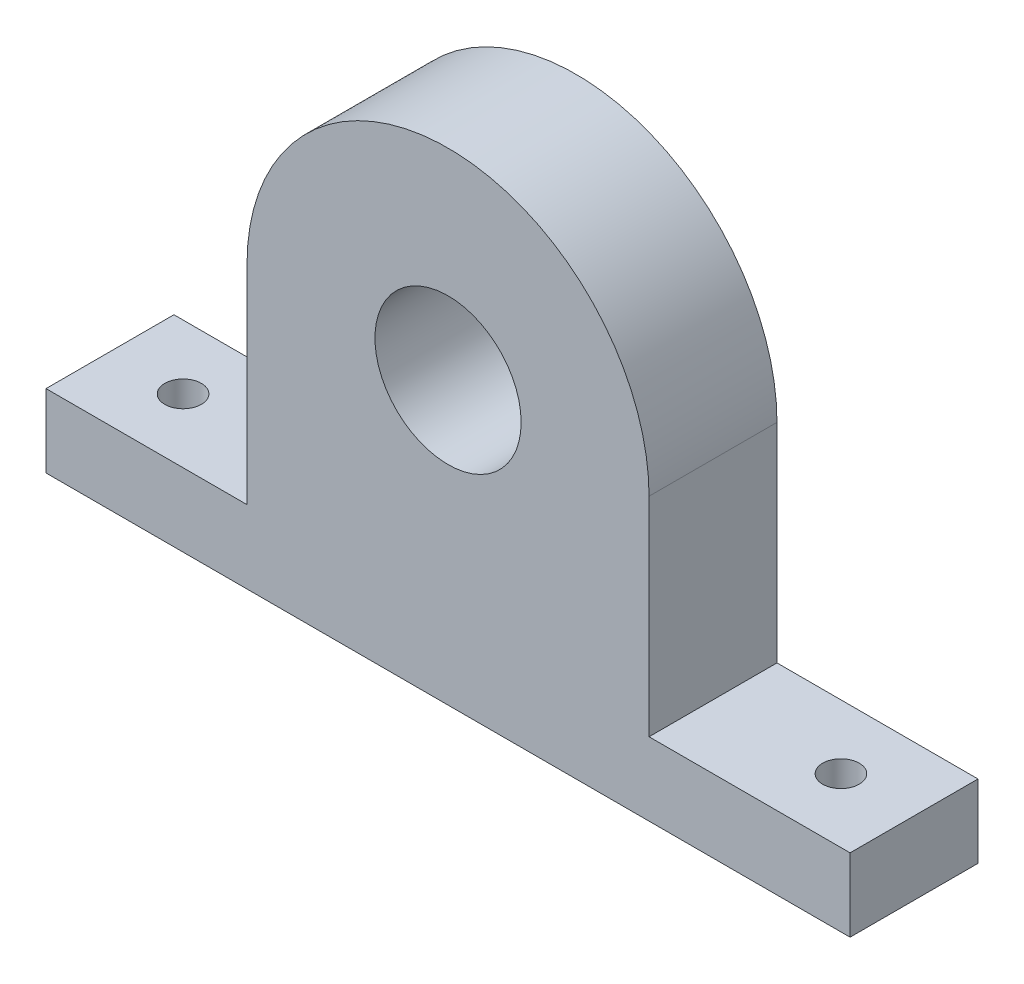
ISO-10303-21;
HEADER;
FILE_DESCRIPTION(('STEP AP214'),'2;1');
FILE_NAME('part.step','',(''),(''),'','','');
FILE_SCHEMA(('AUTOMOTIVE_DESIGN { 1 0 10303 214 1 1 1 1 }'));
ENDSEC;
DATA;
#1=APPLICATION_CONTEXT('core data for automotive mechanical design processes');
#2=APPLICATION_PROTOCOL_DEFINITION('international standard','automotive_design',2000,#1);
#3=PRODUCT_CONTEXT('',#1,'mechanical');
#4=PRODUCT('Part','Part','',(#3));
#5=PRODUCT_RELATED_PRODUCT_CATEGORY('part','',(#4));
#6=PRODUCT_DEFINITION_FORMATION('','',#4);
#7=PRODUCT_DEFINITION_CONTEXT('part definition',#1,'design');
#8=PRODUCT_DEFINITION('design','',#6,#7);
#9=PRODUCT_DEFINITION_SHAPE('','',#8);
#10=(LENGTH_UNIT() NAMED_UNIT(*) SI_UNIT(.MILLI.,.METRE.));
#11=(NAMED_UNIT(*) PLANE_ANGLE_UNIT() SI_UNIT($,.RADIAN.));
#12=(NAMED_UNIT(*) SI_UNIT($,.STERADIAN.) SOLID_ANGLE_UNIT());
#13=UNCERTAINTY_MEASURE_WITH_UNIT(LENGTH_MEASURE(1.E-05),#10,'distance_accuracy_value','');
#14=(GEOMETRIC_REPRESENTATION_CONTEXT(3) GLOBAL_UNCERTAINTY_ASSIGNED_CONTEXT((#13)) GLOBAL_UNIT_ASSIGNED_CONTEXT((#10,
#11,#12)) REPRESENTATION_CONTEXT('',''));
#15=CARTESIAN_POINT('',(0.,0.,0.));
#16=DIRECTION('',(0.,0.,1.));
#17=DIRECTION('',(1.,0.,0.));
#18=AXIS2_PLACEMENT_3D('',#15,#16,#17);
#19=CARTESIAN_POINT('',(55.,-264.765439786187,17.5));
#20=DIRECTION('',(1.,0.,0.));
#21=DIRECTION('',(0.,1.,0.));
#22=AXIS2_PLACEMENT_3D('',#19,#20,#21);
#23=PLANE('',#22);
#24=DIRECTION('',(0.,-1.,0.));
#25=VECTOR('',#24,1.);
#26=CARTESIAN_POINT('',(55.,-264.765439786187,-17.5));
#27=LINE('',#26,#25);
#28=CARTESIAN_POINT('',(55.,0.,-17.5));
#29=VERTEX_POINT('',#28);
#30=CARTESIAN_POINT('',(55.,-57.,-17.5));
#31=VERTEX_POINT('',#30);
#32=EDGE_CURVE('E118',#29,#31,#27,.T.);
#33=ORIENTED_EDGE('',*,*,#32,.F.);
#34=DIRECTION('',(0.,0.,-1.));
#35=VECTOR('',#34,1.);
#36=CARTESIAN_POINT('',(55.,0.,17.5));
#37=LINE('',#36,#35);
#38=CARTESIAN_POINT('',(55.,0.,17.5));
#39=VERTEX_POINT('',#38);
#40=EDGE_CURVE('E11',#39,#29,#37,.T.);
#41=ORIENTED_EDGE('',*,*,#40,.F.);
#42=DIRECTION('',(0.,-1.,0.));
#43=VECTOR('',#42,1.);
#44=CARTESIAN_POINT('',(55.,-264.765439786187,17.5));
#45=LINE('',#44,#43);
#46=CARTESIAN_POINT('',(55.,-57.,17.5));
#47=VERTEX_POINT('',#46);
#48=EDGE_CURVE('E140',#39,#47,#45,.T.);
#49=ORIENTED_EDGE('',*,*,#48,.T.);
#50=DIRECTION('',(0.,0.,-1.));
#51=VECTOR('',#50,1.);
#52=CARTESIAN_POINT('',(55.,-57.,17.5));
#53=LINE('',#52,#51);
#54=EDGE_CURVE('E54',#47,#31,#53,.T.);
#55=ORIENTED_EDGE('',*,*,#54,.T.);
#56=EDGE_LOOP('',(#33,#41,#49,#55));
#57=FACE_BOUND('',#56,.T.);
#58=ADVANCED_FACE('F39',(#57),#23,.T.);
#59=CARTESIAN_POINT('',(0.,0.,17.5));
#60=DIRECTION('',(0.,0.,-1.));
#61=DIRECTION('',(-1.,0.,0.));
#62=AXIS2_PLACEMENT_3D('',#59,#60,#61);
#63=CYLINDRICAL_SURFACE('',#62,55.);
#64=CARTESIAN_POINT('',(0.,0.,-17.5));
#65=DIRECTION('',(0.,0.,1.));
#66=DIRECTION('',(1.,0.,0.));
#67=AXIS2_PLACEMENT_3D('',#64,#65,#66);
#68=CIRCLE('',#67,55.);
#69=CARTESIAN_POINT('',(-55.,0.,-17.5));
#70=VERTEX_POINT('',#69);
#71=EDGE_CURVE('E107',#29,#70,#68,.T.);
#72=ORIENTED_EDGE('',*,*,#71,.T.);
#73=DIRECTION('',(0.,0.,-1.));
#74=VECTOR('',#73,1.);
#75=CARTESIAN_POINT('',(-55.,0.,17.5));
#76=LINE('',#75,#74);
#77=CARTESIAN_POINT('',(-55.,0.,17.5));
#78=VERTEX_POINT('',#77);
#79=EDGE_CURVE('E47',#78,#70,#76,.T.);
#80=ORIENTED_EDGE('',*,*,#79,.F.);
#81=CARTESIAN_POINT('',(0.,0.,17.5));
#82=DIRECTION('',(0.,0.,1.));
#83=DIRECTION('',(1.,0.,0.));
#84=AXIS2_PLACEMENT_3D('',#81,#82,#83);
#85=CIRCLE('',#84,55.);
#86=EDGE_CURVE('E109',#39,#78,#85,.T.);
#87=ORIENTED_EDGE('',*,*,#86,.F.);
#88=ORIENTED_EDGE('',*,*,#40,.T.);
#89=EDGE_LOOP('',(#72,#80,#87,#88));
#90=FACE_BOUND('',#89,.T.);
#91=ADVANCED_FACE('F105',(#90),#63,.T.);
#92=CARTESIAN_POINT('',(-55.,-264.765439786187,17.5));
#93=DIRECTION('',(1.,0.,0.));
#94=DIRECTION('',(0.,0.,-1.));
#95=AXIS2_PLACEMENT_3D('',#92,#93,#94);
#96=PLANE('',#95);
#97=DIRECTION('',(0.,-1.,0.));
#98=VECTOR('',#97,1.);
#99=CARTESIAN_POINT('',(-55.,-264.765439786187,-17.5));
#100=LINE('',#99,#98);
#101=CARTESIAN_POINT('',(-55.,-57.,-17.5));
#102=VERTEX_POINT('',#101);
#103=EDGE_CURVE('E121',#70,#102,#100,.T.);
#104=ORIENTED_EDGE('',*,*,#103,.T.);
#105=DIRECTION('',(0.,0.,-1.));
#106=VECTOR('',#105,1.);
#107=CARTESIAN_POINT('',(-55.,-57.,17.5));
#108=LINE('',#107,#106);
#109=CARTESIAN_POINT('',(-55.,-57.,17.5));
#110=VERTEX_POINT('',#109);
#111=EDGE_CURVE('E165',#110,#102,#108,.T.);
#112=ORIENTED_EDGE('',*,*,#111,.F.);
#113=DIRECTION('',(0.,-1.,0.));
#114=VECTOR('',#113,1.);
#115=CARTESIAN_POINT('',(-55.,-264.765439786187,17.5));
#116=LINE('',#115,#114);
#117=EDGE_CURVE('E143',#78,#110,#116,.T.);
#118=ORIENTED_EDGE('',*,*,#117,.F.);
#119=ORIENTED_EDGE('',*,*,#79,.T.);
#120=EDGE_LOOP('',(#104,#112,#118,#119));
#121=FACE_BOUND('',#120,.T.);
#122=ADVANCED_FACE('F169',(#121),#96,.F.);
#123=CARTESIAN_POINT('',(-2.4878383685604,-57.,17.5));
#124=DIRECTION('',(0.,1.,0.));
#125=DIRECTION('',(0.,0.,1.));
#126=AXIS2_PLACEMENT_3D('',#123,#124,#125);
#127=PLANE('',#126);
#128=CARTESIAN_POINT('',(-90.,-57.,0.));
#129=DIRECTION('',(0.,1.,0.));
#130=DIRECTION('',(0.,0.,1.));
#131=AXIS2_PLACEMENT_3D('',#128,#129,#130);
#132=CIRCLE('',#131,5.);
#133=CARTESIAN_POINT('',(-90.,-57.,4.99999999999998));
#134=VERTEX_POINT('',#133);
#135=EDGE_CURVE('E291',#134,#134,#132,.T.);
#136=ORIENTED_EDGE('',*,*,#135,.F.);
#137=EDGE_LOOP('',(#136));
#138=FACE_BOUND('',#137,.T.);
#139=DIRECTION('',(1.,0.,0.));
#140=VECTOR('',#139,1.);
#141=CARTESIAN_POINT('',(-2.4878383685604,-57.,-17.5));
#142=LINE('',#141,#140);
#143=CARTESIAN_POINT('',(-110.,-57.,-17.5));
#144=VERTEX_POINT('',#143);
#145=EDGE_CURVE('E130',#144,#102,#142,.T.);
#146=ORIENTED_EDGE('',*,*,#145,.F.);
#147=DIRECTION('',(0.,0.,-1.));
#148=VECTOR('',#147,1.);
#149=CARTESIAN_POINT('',(-110.,-57.,17.5));
#150=LINE('',#149,#148);
#151=CARTESIAN_POINT('',(-110.,-57.,17.5));
#152=VERTEX_POINT('',#151);
#153=EDGE_CURVE('E163',#152,#144,#150,.T.);
#154=ORIENTED_EDGE('',*,*,#153,.F.);
#155=DIRECTION('',(1.,0.,0.));
#156=VECTOR('',#155,1.);
#157=CARTESIAN_POINT('',(-2.4878383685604,-57.,17.5));
#158=LINE('',#157,#156);
#159=EDGE_CURVE('E145',#152,#110,#158,.T.);
#160=ORIENTED_EDGE('',*,*,#159,.T.);
#161=ORIENTED_EDGE('',*,*,#111,.T.);
#162=EDGE_LOOP('',(#146,#154,#160,#161));
#163=FACE_BOUND('',#162,.T.);
#164=ADVANCED_FACE('F189',(#138,#163),#127,.T.);
#165=CARTESIAN_POINT('',(-110.,-264.765439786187,17.5));
#166=DIRECTION('',(1.,0.,0.));
#167=DIRECTION('',(0.,0.,-1.));
#168=AXIS2_PLACEMENT_3D('',#165,#166,#167);
#169=PLANE('',#168);
#170=DIRECTION('',(0.,-1.,0.));
#171=VECTOR('',#170,1.);
#172=CARTESIAN_POINT('',(-110.,-264.765439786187,-17.5));
#173=LINE('',#172,#171);
#174=CARTESIAN_POINT('',(-110.,-77.,-17.5));
#175=VERTEX_POINT('',#174);
#176=EDGE_CURVE('E132',#144,#175,#173,.T.);
#177=ORIENTED_EDGE('',*,*,#176,.T.);
#178=DIRECTION('',(0.,0.,-1.));
#179=VECTOR('',#178,1.);
#180=CARTESIAN_POINT('',(-110.,-77.,17.5));
#181=LINE('',#180,#179);
#182=CARTESIAN_POINT('',(-110.,-77.,17.5));
#183=VERTEX_POINT('',#182);
#184=EDGE_CURVE('E160',#183,#175,#181,.T.);
#185=ORIENTED_EDGE('',*,*,#184,.F.);
#186=DIRECTION('',(0.,-1.,0.));
#187=VECTOR('',#186,1.);
#188=CARTESIAN_POINT('',(-110.,-264.765439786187,17.5));
#189=LINE('',#188,#187);
#190=EDGE_CURVE('E148',#152,#183,#189,.T.);
#191=ORIENTED_EDGE('',*,*,#190,.F.);
#192=ORIENTED_EDGE('',*,*,#153,.T.);
#193=EDGE_LOOP('',(#177,#185,#191,#192));
#194=FACE_BOUND('',#193,.T.);
#195=ADVANCED_FACE('F187',(#194),#169,.F.);
#196=CARTESIAN_POINT('',(-2.4878383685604,-77.,17.5));
#197=DIRECTION('',(0.,1.,0.));
#198=DIRECTION('',(0.,0.,1.));
#199=AXIS2_PLACEMENT_3D('',#196,#197,#198);
#200=PLANE('',#199);
#201=CARTESIAN_POINT('',(-90.,-77.,0.));
#202=DIRECTION('',(0.,-1.,0.));
#203=DIRECTION('',(0.,0.,-1.));
#204=AXIS2_PLACEMENT_3D('',#201,#202,#203);
#205=CIRCLE('',#204,5.);
#206=CARTESIAN_POINT('',(-90.,-77.,-5.00000000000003));
#207=VERTEX_POINT('',#206);
#208=EDGE_CURVE('E287',#207,#207,#205,.T.);
#209=ORIENTED_EDGE('',*,*,#208,.F.);
#210=EDGE_LOOP('',(#209));
#211=FACE_BOUND('',#210,.T.);
#212=CARTESIAN_POINT('',(90.,-77.,0.));
#213=DIRECTION('',(0.,-1.,0.));
#214=DIRECTION('',(0.,0.,-1.));
#215=AXIS2_PLACEMENT_3D('',#212,#213,#214);
#216=CIRCLE('',#215,5.);
#217=CARTESIAN_POINT('',(90.,-77.,-5.00000000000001));
#218=VERTEX_POINT('',#217);
#219=EDGE_CURVE('E125',#218,#218,#216,.T.);
#220=ORIENTED_EDGE('',*,*,#219,.F.);
#221=EDGE_LOOP('',(#220));
#222=FACE_BOUND('',#221,.T.);
#223=DIRECTION('',(1.,0.,0.));
#224=VECTOR('',#223,1.);
#225=CARTESIAN_POINT('',(-2.4878383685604,-77.,-17.5));
#226=LINE('',#225,#224);
#227=CARTESIAN_POINT('',(110.,-77.,-17.5));
#228=VERTEX_POINT('',#227);
#229=EDGE_CURVE('E135',#175,#228,#226,.T.);
#230=ORIENTED_EDGE('',*,*,#229,.T.);
#231=DIRECTION('',(0.,0.,-1.));
#232=VECTOR('',#231,1.);
#233=CARTESIAN_POINT('',(110.,-77.,17.5));
#234=LINE('',#233,#232);
#235=CARTESIAN_POINT('',(110.,-77.,17.5));
#236=VERTEX_POINT('',#235);
#237=EDGE_CURVE('E157',#236,#228,#234,.T.);
#238=ORIENTED_EDGE('',*,*,#237,.F.);
#239=DIRECTION('',(1.,0.,0.));
#240=VECTOR('',#239,1.);
#241=CARTESIAN_POINT('',(-2.4878383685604,-77.,17.5));
#242=LINE('',#241,#240);
#243=EDGE_CURVE('E151',#183,#236,#242,.T.);
#244=ORIENTED_EDGE('',*,*,#243,.F.);
#245=ORIENTED_EDGE('',*,*,#184,.T.);
#246=EDGE_LOOP('',(#230,#238,#244,#245));
#247=FACE_BOUND('',#246,.T.);
#248=ADVANCED_FACE('F182',(#211,#222,#247),#200,.F.);
#249=CARTESIAN_POINT('',(110.,-264.765439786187,17.5));
#250=DIRECTION('',(-1.,0.,0.));
#251=DIRECTION('',(0.,-1.,0.));
#252=AXIS2_PLACEMENT_3D('',#249,#250,#251);
#253=PLANE('',#252);
#254=DIRECTION('',(0.,1.,0.));
#255=VECTOR('',#254,1.);
#256=CARTESIAN_POINT('',(110.,-264.765439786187,-17.5));
#257=LINE('',#256,#255);
#258=CARTESIAN_POINT('',(110.,-57.,-17.5));
#259=VERTEX_POINT('',#258);
#260=EDGE_CURVE('E137',#228,#259,#257,.T.);
#261=ORIENTED_EDGE('',*,*,#260,.T.);
#262=DIRECTION('',(0.,0.,-1.));
#263=VECTOR('',#262,1.);
#264=CARTESIAN_POINT('',(110.,-57.,17.5));
#265=LINE('',#264,#263);
#266=CARTESIAN_POINT('',(110.,-57.,17.5));
#267=VERTEX_POINT('',#266);
#268=EDGE_CURVE('E155',#267,#259,#265,.T.);
#269=ORIENTED_EDGE('',*,*,#268,.F.);
#270=DIRECTION('',(0.,1.,0.));
#271=VECTOR('',#270,1.);
#272=CARTESIAN_POINT('',(110.,-264.765439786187,17.5));
#273=LINE('',#272,#271);
#274=EDGE_CURVE('E62',#236,#267,#273,.T.);
#275=ORIENTED_EDGE('',*,*,#274,.F.);
#276=ORIENTED_EDGE('',*,*,#237,.T.);
#277=EDGE_LOOP('',(#261,#269,#275,#276));
#278=FACE_BOUND('',#277,.T.);
#279=ADVANCED_FACE('F176',(#278),#253,.F.);
#280=CARTESIAN_POINT('',(90.,-57.,0.));
#281=DIRECTION('',(0.,1.,0.));
#282=DIRECTION('',(0.,0.,1.));
#283=AXIS2_PLACEMENT_3D('',#280,#281,#282);
#284=CIRCLE('',#283,5.);
#285=CARTESIAN_POINT('',(90.,-57.,5.));
#286=VERTEX_POINT('',#285);
#287=EDGE_CURVE('E42',#286,#286,#284,.T.);
#288=ORIENTED_EDGE('',*,*,#287,.F.);
#289=EDGE_LOOP('',(#288));
#290=FACE_BOUND('',#289,.T.);
#291=EDGE_CURVE('E133',#31,#259,#142,.T.);
#292=ORIENTED_EDGE('',*,*,#291,.F.);
#293=ORIENTED_EDGE('',*,*,#54,.F.);
#294=EDGE_CURVE('E149',#47,#267,#158,.T.);
#295=ORIENTED_EDGE('',*,*,#294,.T.);
#296=ORIENTED_EDGE('',*,*,#268,.T.);
#297=EDGE_LOOP('',(#292,#293,#295,#296));
#298=FACE_BOUND('',#297,.T.);
#299=ADVANCED_FACE('F173',(#290,#298),#127,.T.);
#300=CARTESIAN_POINT('',(-2.4878383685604,-264.765439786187,17.5));
#301=DIRECTION('',(0.,0.,1.));
#302=DIRECTION('',(1.,0.,0.));
#303=AXIS2_PLACEMENT_3D('',#300,#301,#302);
#304=PLANE('',#303);
#305=CARTESIAN_POINT('',(0.,0.,17.5));
#306=DIRECTION('',(0.,0.,1.));
#307=DIRECTION('',(1.,0.,0.));
#308=AXIS2_PLACEMENT_3D('',#305,#306,#307);
#309=CIRCLE('',#308,20.);
#310=CARTESIAN_POINT('',(20.,0.,17.5));
#311=VERTEX_POINT('',#310);
#312=EDGE_CURVE('E285',#311,#311,#309,.T.);
#313=ORIENTED_EDGE('',*,*,#312,.F.);
#314=EDGE_LOOP('',(#313));
#315=FACE_BOUND('',#314,.T.);
#316=ORIENTED_EDGE('',*,*,#48,.F.);
#317=ORIENTED_EDGE('',*,*,#86,.T.);
#318=ORIENTED_EDGE('',*,*,#117,.T.);
#319=ORIENTED_EDGE('',*,*,#159,.F.);
#320=ORIENTED_EDGE('',*,*,#190,.T.);
#321=ORIENTED_EDGE('',*,*,#243,.T.);
#322=ORIENTED_EDGE('',*,*,#274,.T.);
#323=ORIENTED_EDGE('',*,*,#294,.F.);
#324=EDGE_LOOP('',(#316,#317,#318,#319,#320,#321,#322,#323));
#325=FACE_BOUND('',#324,.T.);
#326=ADVANCED_FACE('F172',(#315,#325),#304,.T.);
#327=CARTESIAN_POINT('',(-2.4878383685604,-264.765439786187,-17.5));
#328=DIRECTION('',(0.,0.,1.));
#329=DIRECTION('',(1.,0.,0.));
#330=AXIS2_PLACEMENT_3D('',#327,#328,#329);
#331=PLANE('',#330);
#332=CARTESIAN_POINT('',(0.,0.,-17.5));
#333=DIRECTION('',(0.,0.,1.));
#334=DIRECTION('',(1.,0.,0.));
#335=AXIS2_PLACEMENT_3D('',#332,#333,#334);
#336=CIRCLE('',#335,20.);
#337=CARTESIAN_POINT('',(20.,0.,-17.5));
#338=VERTEX_POINT('',#337);
#339=EDGE_CURVE('E282',#338,#338,#336,.T.);
#340=ORIENTED_EDGE('',*,*,#339,.T.);
#341=EDGE_LOOP('',(#340));
#342=FACE_BOUND('',#341,.T.);
#343=ORIENTED_EDGE('',*,*,#32,.T.);
#344=ORIENTED_EDGE('',*,*,#291,.T.);
#345=ORIENTED_EDGE('',*,*,#260,.F.);
#346=ORIENTED_EDGE('',*,*,#229,.F.);
#347=ORIENTED_EDGE('',*,*,#176,.F.);
#348=ORIENTED_EDGE('',*,*,#145,.T.);
#349=ORIENTED_EDGE('',*,*,#103,.F.);
#350=ORIENTED_EDGE('',*,*,#71,.F.);
#351=EDGE_LOOP('',(#343,#344,#345,#346,#347,#348,#349,#350));
#352=FACE_BOUND('',#351,.T.);
#353=ADVANCED_FACE('F116',(#342,#352),#331,.F.);
#354=CARTESIAN_POINT('',(90.,-42.,0.));
#355=DIRECTION('',(0.,-1.,0.));
#356=DIRECTION('',(0.,0.,-1.));
#357=AXIS2_PLACEMENT_3D('',#354,#355,#356);
#358=CYLINDRICAL_SURFACE('',#357,5.);
#359=ORIENTED_EDGE('',*,*,#287,.T.);
#360=EDGE_LOOP('',(#359));
#361=FACE_BOUND('',#360,.T.);
#362=ORIENTED_EDGE('',*,*,#219,.T.);
#363=EDGE_LOOP('',(#362));
#364=FACE_BOUND('',#363,.T.);
#365=ADVANCED_FACE('F242',(#361,#364),#358,.F.);
#366=CARTESIAN_POINT('',(-90.,-42.,0.));
#367=DIRECTION('',(0.,-1.,0.));
#368=DIRECTION('',(0.,0.,-1.));
#369=AXIS2_PLACEMENT_3D('',#366,#367,#368);
#370=CYLINDRICAL_SURFACE('',#369,5.);
#371=ORIENTED_EDGE('',*,*,#135,.T.);
#372=EDGE_LOOP('',(#371));
#373=FACE_BOUND('',#372,.T.);
#374=ORIENTED_EDGE('',*,*,#208,.T.);
#375=EDGE_LOOP('',(#374));
#376=FACE_BOUND('',#375,.T.);
#377=ADVANCED_FACE('F246',(#373,#376),#370,.F.);
#378=CARTESIAN_POINT('',(0.,0.,-17.5));
#379=DIRECTION('',(0.,0.,1.));
#380=DIRECTION('',(1.,0.,0.));
#381=AXIS2_PLACEMENT_3D('',#378,#379,#380);
#382=CYLINDRICAL_SURFACE('',#381,20.);
#383=ORIENTED_EDGE('',*,*,#339,.F.);
#384=EDGE_LOOP('',(#383));
#385=FACE_BOUND('',#384,.T.);
#386=ORIENTED_EDGE('',*,*,#312,.T.);
#387=EDGE_LOOP('',(#386));
#388=FACE_BOUND('',#387,.T.);
#389=ADVANCED_FACE('F255',(#385,#388),#382,.F.);
#390=CLOSED_SHELL('',(#58,#91,#122,#164,#195,#248,#279,#299,#326,#353,#365,#377,#389));
#391=MANIFOLD_SOLID_BREP('B2',#390);
#392=ADVANCED_BREP_SHAPE_REPRESENTATION('',(#18,#391),#14);
#393=SHAPE_DEFINITION_REPRESENTATION(#9,#392);
ENDSEC;
END-ISO-10303-21;
